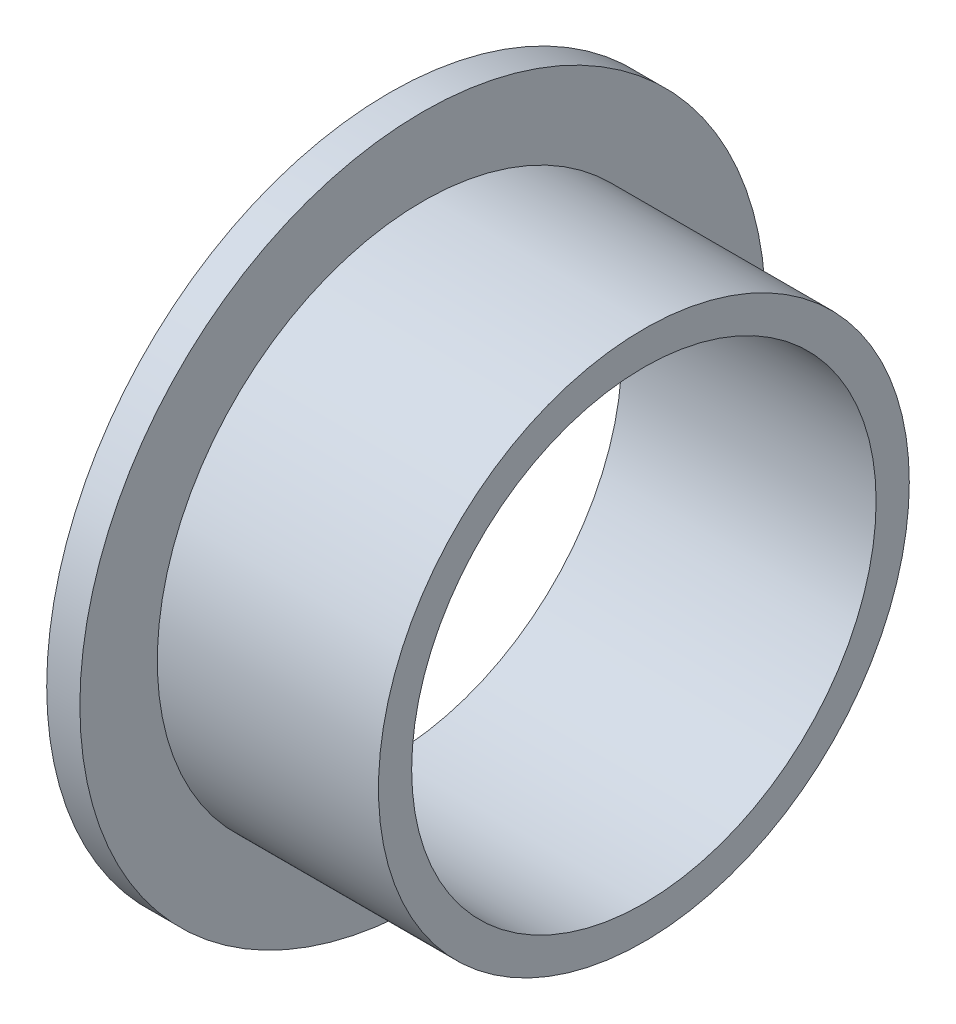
from build123d import *


with BuildPart() as part:
    # Sketch1 → Revolve1 (revolve)
    with BuildSketch(Plane.XY, mode=Mode.PRIVATE) as revolve1_sk:
        Polygon((-46, 62), (-40, 62), (-40, 48), (0, 48), (0, 42), (-46, 42), align=None)
    revolve(revolve1_sk.sketch.rotate(Axis((0, 0, 0), (-1, 0, 0)), 90), axis=Axis((0, 0, 0), (-1, 0, 0)))


solid = part.part
